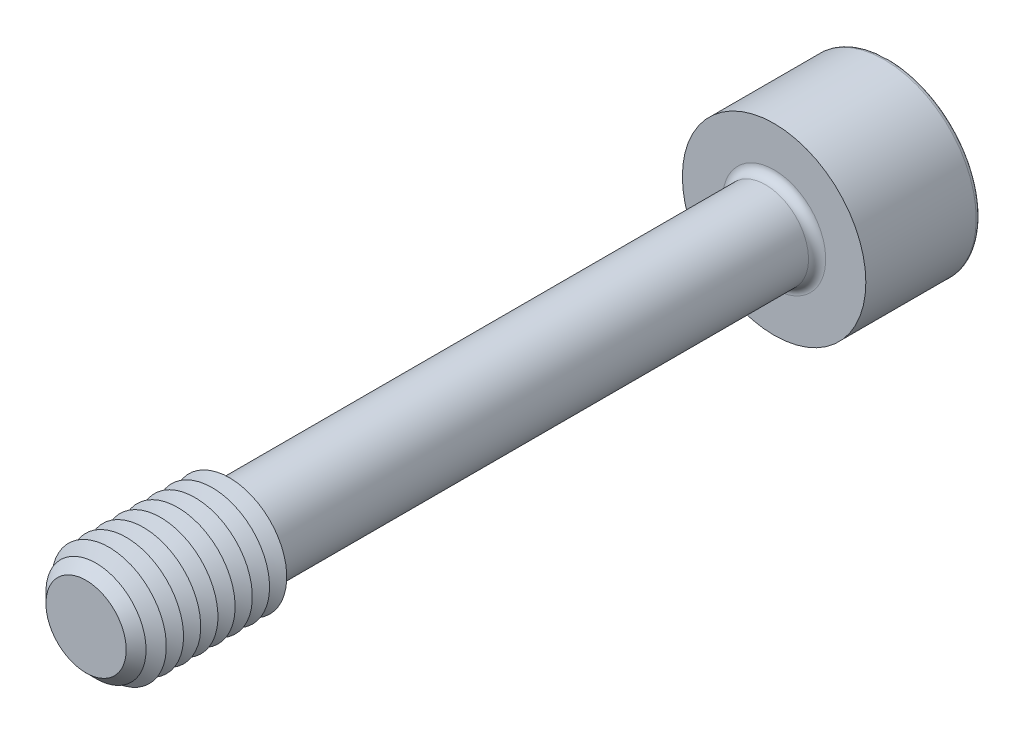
from build123d import *

# Parameters (mm, degrees)
SKETCH1_R       = 3.75
EXTRUDE1_DEPTH  = 30
CHAMFER1_SIZE   = 1.5
SKETCH3_R       = 8
EXTRUDE2_DEPTH  = 10
EXTRUDE3_DEPTH  = 8
FILLET1_R       = 0.75
FILLET2_R       = 0.375
LPATTERN1_COUNT = 8
LPATTERN1_PITCH = 1.5


with BuildPart() as part:
    # Sketch1 → Extrude1 (new, symmetric)
    with BuildSketch(Plane.XY):
        Circle(SKETCH1_R)
    extrude(amount=EXTRUDE1_DEPTH, both=True)

    # Sketch2 → Revolve1 (revolve)
    with BuildSketch(Plane(origin=(0, 0, 0), x_dir=(0, 0, -1), z_dir=(1, 0, 0))):
        Polygon((-30, 0), (-30, 5), (-17.5, 5), (-16.778312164, 3.75), (-16.778312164, 0), align=None)
    revolve(axis=Axis((0, 0, 16.778312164), (0, 0, 1)))

    # Chamfer1
    chamfer1_edges = [part.edges().sort_by_distance(p)[0] for p in [
        (0, -5, 30),
    ]]
    chamfer(chamfer1_edges, length=CHAMFER1_SIZE)

    # Sketch3 → Extrude2 (add)
    with BuildSketch(Plane(origin=(0, 0, -30), x_dir=(-1, 0, 0), z_dir=(0, 0, -1))):
        Circle(SKETCH3_R)
    extrude(amount=EXTRUDE2_DEPTH)

    # Sketch4 → Extrude3 (cut)
    with BuildSketch(Plane(origin=(-13.7, 0, -40), x_dir=(1, 0, 0), z_dir=(0, 0, 1))):
        Polygon((11.390598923, -4), (16.009401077, -4), (18.318802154, 0), (16.009401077, 4), (11.390598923, 4), (9.081197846, 0), align=None)
    extrude(amount=EXTRUDE3_DEPTH, mode=Mode.SUBTRACT)

    # Fillet1
    fillet1_edges = [part.edges().sort_by_distance(p)[0] for p in [
        (-3.75, 0, -30),
    ]]
    fillet(fillet1_edges, radius=FILLET1_R)

    # Fillet2
    fillet2_edges = [part.edges().sort_by_distance(p)[0] for p in [
        (8, 0, -40),
    ]]
    fillet(fillet2_edges, radius=FILLET2_R)

    # Sketch5 → Cut-Revolve1 (revolve, cut)
    with BuildSketch(Plane(origin=(0, 0, 0), x_dir=(0, 0, -1), z_dir=(1, 0, 0)), mode=Mode.PRIVATE) as cut_revolve1_sk:
        Polygon((32, 0), (32, -4), (29.690598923, 0), align=None)
    revolve(cut_revolve1_sk.sketch.rotate(Axis((0, 0, -29.690598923), (0, 0, -1)), 90), axis=Axis((0, 0, -29.690598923), (0, 0, -1)), mode=Mode.SUBTRACT)

    # Sketch7 → Cut-Revolve2 (revolve, cut)
    with BuildSketch(Plane(origin=(0, 0, 0), x_dir=(0, 0, -1), z_dir=(1, 0, 0)), mode=Mode.PRIVATE) as cut_revolve2_sk:
        Polygon((-17.5, 5), (-18.25, 3.700961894), (-19, 5), align=None)
    cut_revolve2 = revolve(cut_revolve2_sk.sketch.rotate(Axis((0, 0, -1.332048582), (0, 0, 1)), 90), axis=Axis((0, 0, -1.332048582), (0, 0, 1)), mode=Mode.SUBTRACT)

    # LPattern1: Cut-Revolve2 ×8
    with Locations(*[(0, 0, i * LPATTERN1_PITCH) for i in range(1, LPATTERN1_COUNT)]):
        add(cut_revolve2, mode=Mode.SUBTRACT)


solid = part.part
